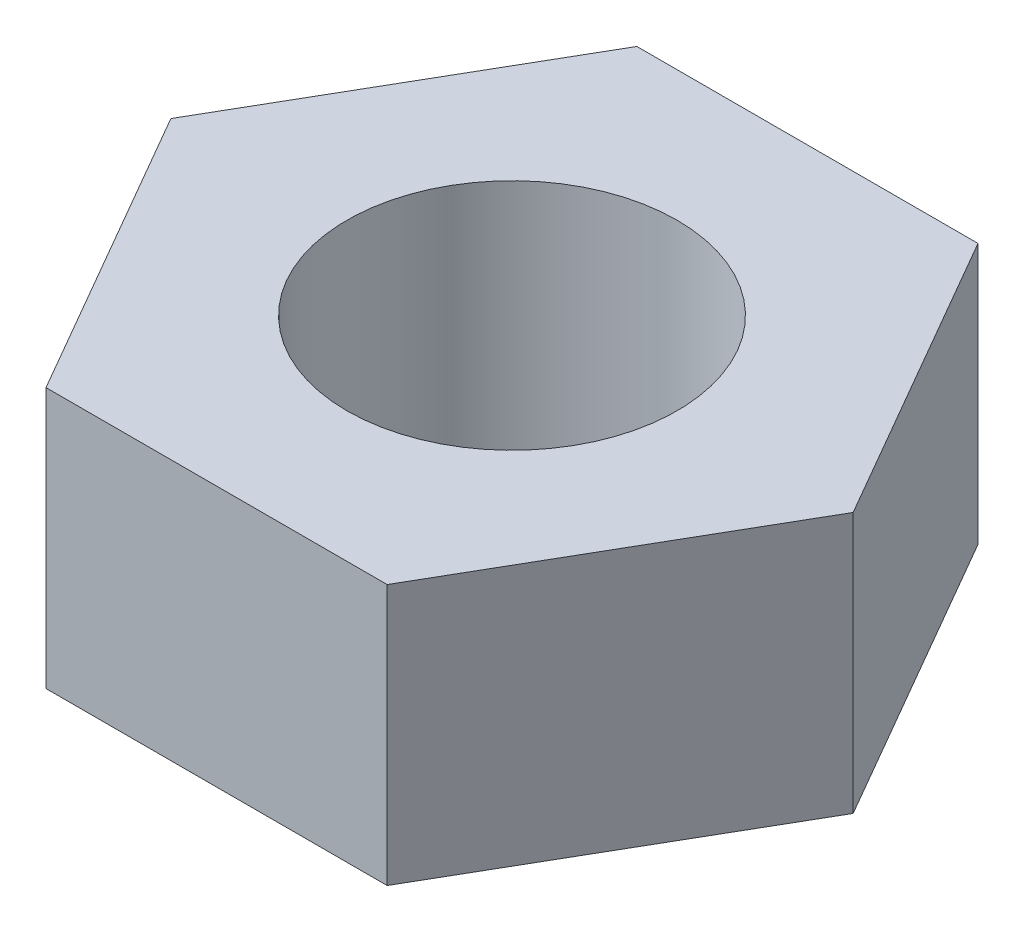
ISO-10303-21;
HEADER;
FILE_DESCRIPTION(('STEP AP214'),'2;1');
FILE_NAME('part.step','',(''),(''),'','','');
FILE_SCHEMA(('AUTOMOTIVE_DESIGN { 1 0 10303 214 1 1 1 1 }'));
ENDSEC;
DATA;
#1=APPLICATION_CONTEXT('core data for automotive mechanical design processes');
#2=APPLICATION_PROTOCOL_DEFINITION('international standard','automotive_design',2000,#1);
#3=PRODUCT_CONTEXT('',#1,'mechanical');
#4=PRODUCT('Part','Part','',(#3));
#5=PRODUCT_RELATED_PRODUCT_CATEGORY('part','',(#4));
#6=PRODUCT_DEFINITION_FORMATION('','',#4);
#7=PRODUCT_DEFINITION_CONTEXT('part definition',#1,'design');
#8=PRODUCT_DEFINITION('design','',#6,#7);
#9=PRODUCT_DEFINITION_SHAPE('','',#8);
#10=(LENGTH_UNIT() NAMED_UNIT(*) SI_UNIT(.MILLI.,.METRE.));
#11=(NAMED_UNIT(*) PLANE_ANGLE_UNIT() SI_UNIT($,.RADIAN.));
#12=(NAMED_UNIT(*) SI_UNIT($,.STERADIAN.) SOLID_ANGLE_UNIT());
#13=UNCERTAINTY_MEASURE_WITH_UNIT(LENGTH_MEASURE(1.E-05),#10,'distance_accuracy_value','');
#14=(GEOMETRIC_REPRESENTATION_CONTEXT(3) GLOBAL_UNCERTAINTY_ASSIGNED_CONTEXT((#13)) GLOBAL_UNIT_ASSIGNED_CONTEXT((#10,
#11,#12)) REPRESENTATION_CONTEXT('',''));
#15=CARTESIAN_POINT('',(0.,0.,0.));
#16=DIRECTION('',(0.,0.,1.));
#17=DIRECTION('',(1.,0.,0.));
#18=AXIS2_PLACEMENT_3D('',#15,#16,#17);
#19=CARTESIAN_POINT('',(0.,3.,0.));
#20=DIRECTION('',(0.,1.,0.));
#21=DIRECTION('',(0.,0.,1.));
#22=AXIS2_PLACEMENT_3D('',#19,#20,#21);
#23=PLANE('',#22);
#24=DIRECTION('',(0.5,0.,-0.866025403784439));
#25=VECTOR('',#24,1.);
#26=CARTESIAN_POINT('',(1.96299091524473,3.,3.4));
#27=LINE('',#26,#25);
#28=CARTESIAN_POINT('',(1.96299091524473,3.,3.4));
#29=VERTEX_POINT('',#28);
#30=CARTESIAN_POINT('',(3.92598183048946,3.,0.));
#31=VERTEX_POINT('',#30);
#32=EDGE_CURVE('E152',#29,#31,#27,.T.);
#33=ORIENTED_EDGE('',*,*,#32,.T.);
#34=DIRECTION('',(-0.5,0.,-0.866025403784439));
#35=VECTOR('',#34,1.);
#36=CARTESIAN_POINT('',(3.92598183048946,3.,0.));
#37=LINE('',#36,#35);
#38=CARTESIAN_POINT('',(1.96299091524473,3.,-3.4));
#39=VERTEX_POINT('',#38);
#40=EDGE_CURVE('E99',#31,#39,#37,.T.);
#41=ORIENTED_EDGE('',*,*,#40,.T.);
#42=DIRECTION('',(-1.,0.,0.));
#43=VECTOR('',#42,1.);
#44=CARTESIAN_POINT('',(1.96299091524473,3.,-3.4));
#45=LINE('',#44,#43);
#46=CARTESIAN_POINT('',(-1.96299091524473,3.,-3.4));
#47=VERTEX_POINT('',#46);
#48=EDGE_CURVE('E111',#39,#47,#45,.T.);
#49=ORIENTED_EDGE('',*,*,#48,.T.);
#50=DIRECTION('',(-0.5,0.,0.866025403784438));
#51=VECTOR('',#50,1.);
#52=CARTESIAN_POINT('',(-1.96299091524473,3.,-3.4));
#53=LINE('',#52,#51);
#54=CARTESIAN_POINT('',(-3.92598183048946,3.,0.));
#55=VERTEX_POINT('',#54);
#56=EDGE_CURVE('E107',#47,#55,#53,.T.);
#57=ORIENTED_EDGE('',*,*,#56,.T.);
#58=DIRECTION('',(0.5,0.,0.866025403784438));
#59=VECTOR('',#58,1.);
#60=CARTESIAN_POINT('',(-3.92598183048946,3.,0.));
#61=LINE('',#60,#59);
#62=CARTESIAN_POINT('',(-1.96299091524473,3.,3.4));
#63=VERTEX_POINT('',#62);
#64=EDGE_CURVE('E112',#55,#63,#61,.T.);
#65=ORIENTED_EDGE('',*,*,#64,.T.);
#66=DIRECTION('',(1.,0.,0.));
#67=VECTOR('',#66,1.);
#68=CARTESIAN_POINT('',(-1.96299091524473,3.,3.4));
#69=LINE('',#68,#67);
#70=EDGE_CURVE('E64',#63,#29,#69,.T.);
#71=ORIENTED_EDGE('',*,*,#70,.T.);
#72=EDGE_LOOP('',(#33,#41,#49,#57,#65,#71));
#73=FACE_BOUND('',#72,.T.);
#74=CARTESIAN_POINT('',(0.,3.,0.));
#75=DIRECTION('',(0.,1.,0.));
#76=DIRECTION('',(0.,0.,1.));
#77=AXIS2_PLACEMENT_3D('',#74,#75,#76);
#78=CIRCLE('',#77,1.9);
#79=CARTESIAN_POINT('',(0.,3.,1.9));
#80=VERTEX_POINT('',#79);
#81=EDGE_CURVE('E139',#80,#80,#78,.T.);
#82=ORIENTED_EDGE('',*,*,#81,.F.);
#83=EDGE_LOOP('',(#82));
#84=FACE_BOUND('',#83,.T.);
#85=ADVANCED_FACE('F44',(#73,#84),#23,.T.);
#86=CARTESIAN_POINT('',(0.,0.,0.));
#87=DIRECTION('',(0.,1.,0.));
#88=DIRECTION('',(0.,0.,1.));
#89=AXIS2_PLACEMENT_3D('',#86,#87,#88);
#90=PLANE('',#89);
#91=DIRECTION('',(0.5,0.,-0.866025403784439));
#92=VECTOR('',#91,1.);
#93=CARTESIAN_POINT('',(1.96299091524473,0.,3.4));
#94=LINE('',#93,#92);
#95=CARTESIAN_POINT('',(1.96299091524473,0.,3.4));
#96=VERTEX_POINT('',#95);
#97=CARTESIAN_POINT('',(3.92598183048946,0.,0.));
#98=VERTEX_POINT('',#97);
#99=EDGE_CURVE('E134',#96,#98,#94,.T.);
#100=ORIENTED_EDGE('',*,*,#99,.F.);
#101=DIRECTION('',(1.,0.,0.));
#102=VECTOR('',#101,1.);
#103=CARTESIAN_POINT('',(-1.96299091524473,0.,3.4));
#104=LINE('',#103,#102);
#105=CARTESIAN_POINT('',(-1.96299091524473,0.,3.4));
#106=VERTEX_POINT('',#105);
#107=EDGE_CURVE('E95',#106,#96,#104,.T.);
#108=ORIENTED_EDGE('',*,*,#107,.F.);
#109=DIRECTION('',(0.5,0.,0.866025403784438));
#110=VECTOR('',#109,1.);
#111=CARTESIAN_POINT('',(-3.92598183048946,0.,0.));
#112=LINE('',#111,#110);
#113=CARTESIAN_POINT('',(-3.92598183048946,0.,0.));
#114=VERTEX_POINT('',#113);
#115=EDGE_CURVE('E86',#114,#106,#112,.T.);
#116=ORIENTED_EDGE('',*,*,#115,.F.);
#117=DIRECTION('',(-0.5,0.,0.866025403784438));
#118=VECTOR('',#117,1.);
#119=CARTESIAN_POINT('',(-1.96299091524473,0.,-3.4));
#120=LINE('',#119,#118);
#121=CARTESIAN_POINT('',(-1.96299091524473,0.,-3.4));
#122=VERTEX_POINT('',#121);
#123=EDGE_CURVE('E122',#122,#114,#120,.T.);
#124=ORIENTED_EDGE('',*,*,#123,.F.);
#125=DIRECTION('',(-1.,0.,0.));
#126=VECTOR('',#125,1.);
#127=CARTESIAN_POINT('',(1.96299091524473,0.,-3.4));
#128=LINE('',#127,#126);
#129=CARTESIAN_POINT('',(1.96299091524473,0.,-3.4));
#130=VERTEX_POINT('',#129);
#131=EDGE_CURVE('E142',#130,#122,#128,.T.);
#132=ORIENTED_EDGE('',*,*,#131,.F.);
#133=DIRECTION('',(-0.5,0.,-0.866025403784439));
#134=VECTOR('',#133,1.);
#135=CARTESIAN_POINT('',(3.92598183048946,0.,0.));
#136=LINE('',#135,#134);
#137=EDGE_CURVE('E137',#98,#130,#136,.T.);
#138=ORIENTED_EDGE('',*,*,#137,.F.);
#139=EDGE_LOOP('',(#100,#108,#116,#124,#132,#138));
#140=FACE_BOUND('',#139,.T.);
#141=CARTESIAN_POINT('',(0.,0.,0.));
#142=DIRECTION('',(0.,1.,0.));
#143=DIRECTION('',(0.,0.,1.));
#144=AXIS2_PLACEMENT_3D('',#141,#142,#143);
#145=CIRCLE('',#144,1.9);
#146=CARTESIAN_POINT('',(0.,0.,1.9));
#147=VERTEX_POINT('',#146);
#148=EDGE_CURVE('E249',#147,#147,#145,.T.);
#149=ORIENTED_EDGE('',*,*,#148,.T.);
#150=EDGE_LOOP('',(#149));
#151=FACE_BOUND('',#150,.T.);
#152=ADVANCED_FACE('F165',(#140,#151),#90,.F.);
#153=CARTESIAN_POINT('',(1.96299091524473,3.,3.4));
#154=DIRECTION('',(-0.866025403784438,0.,-0.5));
#155=DIRECTION('',(-0.5,0.,0.866025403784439));
#156=AXIS2_PLACEMENT_3D('',#153,#154,#155);
#157=PLANE('',#156);
#158=ORIENTED_EDGE('',*,*,#99,.T.);
#159=DIRECTION('',(0.,-1.,0.));
#160=VECTOR('',#159,1.);
#161=CARTESIAN_POINT('',(3.92598183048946,3.,0.));
#162=LINE('',#161,#160);
#163=EDGE_CURVE('E11',#31,#98,#162,.T.);
#164=ORIENTED_EDGE('',*,*,#163,.F.);
#165=ORIENTED_EDGE('',*,*,#32,.F.);
#166=DIRECTION('',(0.,-1.,0.));
#167=VECTOR('',#166,1.);
#168=CARTESIAN_POINT('',(1.96299091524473,3.,3.4));
#169=LINE('',#168,#167);
#170=EDGE_CURVE('E131',#29,#96,#169,.T.);
#171=ORIENTED_EDGE('',*,*,#170,.T.);
#172=EDGE_LOOP('',(#158,#164,#165,#171));
#173=FACE_BOUND('',#172,.T.);
#174=ADVANCED_FACE('F50',(#173),#157,.F.);
#175=CARTESIAN_POINT('',(3.92598183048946,3.,0.));
#176=DIRECTION('',(-0.866025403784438,0.,0.5));
#177=DIRECTION('',(0.5,0.,0.866025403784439));
#178=AXIS2_PLACEMENT_3D('',#175,#176,#177);
#179=PLANE('',#178);
#180=ORIENTED_EDGE('',*,*,#137,.T.);
#181=DIRECTION('',(0.,-1.,0.));
#182=VECTOR('',#181,1.);
#183=CARTESIAN_POINT('',(1.96299091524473,3.,-3.4));
#184=LINE('',#183,#182);
#185=EDGE_CURVE('E54',#39,#130,#184,.T.);
#186=ORIENTED_EDGE('',*,*,#185,.F.);
#187=ORIENTED_EDGE('',*,*,#40,.F.);
#188=ORIENTED_EDGE('',*,*,#163,.T.);
#189=EDGE_LOOP('',(#180,#186,#187,#188));
#190=FACE_BOUND('',#189,.T.);
#191=ADVANCED_FACE('F189',(#190),#179,.F.);
#192=CARTESIAN_POINT('',(1.96299091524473,3.,-3.4));
#193=DIRECTION('',(0.,0.,1.));
#194=DIRECTION('',(1.,0.,0.));
#195=AXIS2_PLACEMENT_3D('',#192,#193,#194);
#196=PLANE('',#195);
#197=ORIENTED_EDGE('',*,*,#131,.T.);
#198=DIRECTION('',(0.,-1.,0.));
#199=VECTOR('',#198,1.);
#200=CARTESIAN_POINT('',(-1.96299091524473,3.,-3.4));
#201=LINE('',#200,#199);
#202=EDGE_CURVE('E125',#47,#122,#201,.T.);
#203=ORIENTED_EDGE('',*,*,#202,.F.);
#204=ORIENTED_EDGE('',*,*,#48,.F.);
#205=ORIENTED_EDGE('',*,*,#185,.T.);
#206=EDGE_LOOP('',(#197,#203,#204,#205));
#207=FACE_BOUND('',#206,.T.);
#208=ADVANCED_FACE('F162',(#207),#196,.F.);
#209=CARTESIAN_POINT('',(-1.96299091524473,3.,-3.4));
#210=DIRECTION('',(0.866025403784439,0.,0.5));
#211=DIRECTION('',(0.5,0.,-0.866025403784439));
#212=AXIS2_PLACEMENT_3D('',#209,#210,#211);
#213=PLANE('',#212);
#214=ORIENTED_EDGE('',*,*,#123,.T.);
#215=DIRECTION('',(0.,-1.,0.));
#216=VECTOR('',#215,1.);
#217=CARTESIAN_POINT('',(-3.92598183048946,3.,0.));
#218=LINE('',#217,#216);
#219=EDGE_CURVE('E118',#55,#114,#218,.T.);
#220=ORIENTED_EDGE('',*,*,#219,.F.);
#221=ORIENTED_EDGE('',*,*,#56,.F.);
#222=ORIENTED_EDGE('',*,*,#202,.T.);
#223=EDGE_LOOP('',(#214,#220,#221,#222));
#224=FACE_BOUND('',#223,.T.);
#225=ADVANCED_FACE('F120',(#224),#213,.F.);
#226=CARTESIAN_POINT('',(-3.92598183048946,3.,0.));
#227=DIRECTION('',(0.866025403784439,0.,-0.5));
#228=DIRECTION('',(-0.5,0.,-0.866025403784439));
#229=AXIS2_PLACEMENT_3D('',#226,#227,#228);
#230=PLANE('',#229);
#231=ORIENTED_EDGE('',*,*,#115,.T.);
#232=DIRECTION('',(0.,-1.,0.));
#233=VECTOR('',#232,1.);
#234=CARTESIAN_POINT('',(-1.96299091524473,3.,3.4));
#235=LINE('',#234,#233);
#236=EDGE_CURVE('E124',#63,#106,#235,.T.);
#237=ORIENTED_EDGE('',*,*,#236,.F.);
#238=ORIENTED_EDGE('',*,*,#64,.F.);
#239=ORIENTED_EDGE('',*,*,#219,.T.);
#240=EDGE_LOOP('',(#231,#237,#238,#239));
#241=FACE_BOUND('',#240,.T.);
#242=ADVANCED_FACE('F130',(#241),#230,.F.);
#243=CARTESIAN_POINT('',(-1.96299091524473,3.,3.4));
#244=DIRECTION('',(0.,0.,-1.));
#245=DIRECTION('',(-1.,0.,0.));
#246=AXIS2_PLACEMENT_3D('',#243,#244,#245);
#247=PLANE('',#246);
#248=ORIENTED_EDGE('',*,*,#107,.T.);
#249=ORIENTED_EDGE('',*,*,#170,.F.);
#250=ORIENTED_EDGE('',*,*,#70,.F.);
#251=ORIENTED_EDGE('',*,*,#236,.T.);
#252=EDGE_LOOP('',(#248,#249,#250,#251));
#253=FACE_BOUND('',#252,.T.);
#254=ADVANCED_FACE('F169',(#253),#247,.F.);
#255=CARTESIAN_POINT('',(0.,3.,0.));
#256=DIRECTION('',(0.,-1.,0.));
#257=DIRECTION('',(0.,0.,-1.));
#258=AXIS2_PLACEMENT_3D('',#255,#256,#257);
#259=CYLINDRICAL_SURFACE('',#258,1.9);
#260=ORIENTED_EDGE('',*,*,#81,.T.);
#261=EDGE_LOOP('',(#260));
#262=FACE_BOUND('',#261,.T.);
#263=ORIENTED_EDGE('',*,*,#148,.F.);
#264=EDGE_LOOP('',(#263));
#265=FACE_BOUND('',#264,.T.);
#266=ADVANCED_FACE('F175',(#262,#265),#259,.F.);
#267=CLOSED_SHELL('',(#85,#152,#174,#191,#208,#225,#242,#254,#266));
#268=MANIFOLD_SOLID_BREP('B2',#267);
#269=ADVANCED_BREP_SHAPE_REPRESENTATION('',(#18,#268),#14);
#270=SHAPE_DEFINITION_REPRESENTATION(#9,#269);
ENDSEC;
END-ISO-10303-21;
